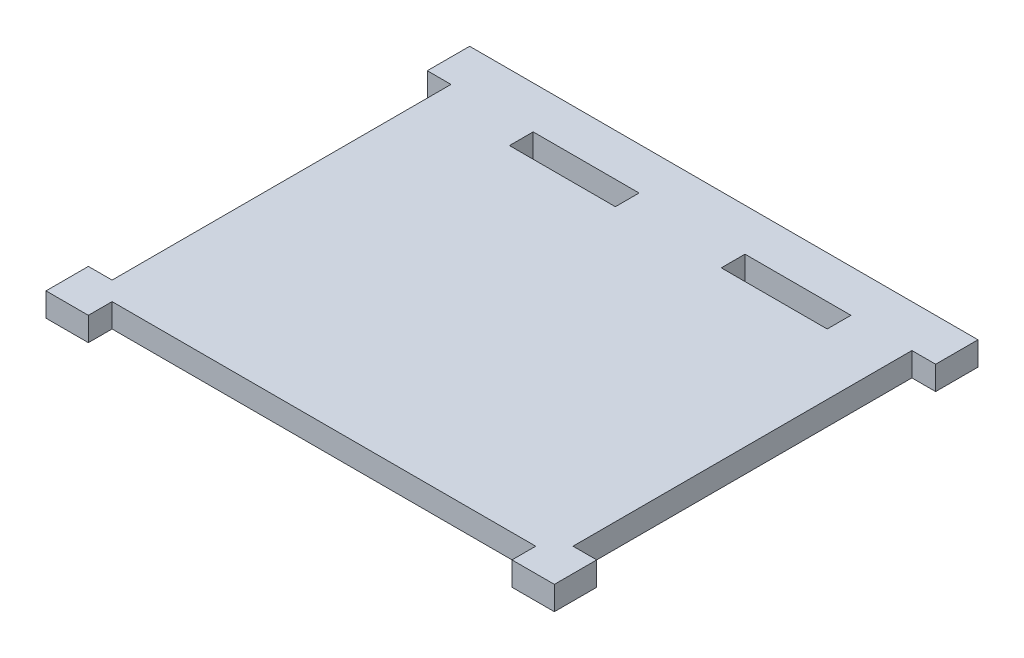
ISO-10303-21;
HEADER;
FILE_DESCRIPTION(('STEP AP214'),'2;1');
FILE_NAME('part.step','',(''),(''),'','','');
FILE_SCHEMA(('AUTOMOTIVE_DESIGN { 1 0 10303 214 1 1 1 1 }'));
ENDSEC;
DATA;
#1=APPLICATION_CONTEXT('core data for automotive mechanical design processes');
#2=APPLICATION_PROTOCOL_DEFINITION('international standard','automotive_design',2000,#1);
#3=PRODUCT_CONTEXT('',#1,'mechanical');
#4=PRODUCT('Part','Part','',(#3));
#5=PRODUCT_RELATED_PRODUCT_CATEGORY('part','',(#4));
#6=PRODUCT_DEFINITION_FORMATION('','',#4);
#7=PRODUCT_DEFINITION_CONTEXT('part definition',#1,'design');
#8=PRODUCT_DEFINITION('design','',#6,#7);
#9=PRODUCT_DEFINITION_SHAPE('','',#8);
#10=(LENGTH_UNIT() NAMED_UNIT(*) SI_UNIT(.MILLI.,.METRE.));
#11=(NAMED_UNIT(*) PLANE_ANGLE_UNIT() SI_UNIT($,.RADIAN.));
#12=(NAMED_UNIT(*) SI_UNIT($,.STERADIAN.) SOLID_ANGLE_UNIT());
#13=UNCERTAINTY_MEASURE_WITH_UNIT(LENGTH_MEASURE(1.E-05),#10,'distance_accuracy_value','');
#14=(GEOMETRIC_REPRESENTATION_CONTEXT(3) GLOBAL_UNCERTAINTY_ASSIGNED_CONTEXT((#13)) GLOBAL_UNIT_ASSIGNED_CONTEXT((#10,
#11,#12)) REPRESENTATION_CONTEXT('',''));
#15=CARTESIAN_POINT('',(0.,0.,0.));
#16=DIRECTION('',(0.,0.,1.));
#17=DIRECTION('',(1.,0.,0.));
#18=AXIS2_PLACEMENT_3D('',#15,#16,#17);
#19=CARTESIAN_POINT('',(0.,2.8,0.));
#20=DIRECTION('',(1.,0.,0.));
#21=DIRECTION('',(0.,0.,-1.));
#22=AXIS2_PLACEMENT_3D('',#19,#20,#21);
#23=PLANE('',#22);
#24=DIRECTION('',(0.,0.,1.));
#25=VECTOR('',#24,1.);
#26=CARTESIAN_POINT('',(0.,0.,0.));
#27=LINE('',#26,#25);
#28=CARTESIAN_POINT('',(0.,0.,-50.));
#29=VERTEX_POINT('',#28);
#30=CARTESIAN_POINT('',(0.,0.,-45.));
#31=VERTEX_POINT('',#30);
#32=EDGE_CURVE('E355',#29,#31,#27,.T.);
#33=ORIENTED_EDGE('',*,*,#32,.T.);
#34=DIRECTION('',(0.,1.,0.));
#35=VECTOR('',#34,1.);
#36=CARTESIAN_POINT('',(0.,0.,-45.));
#37=LINE('',#36,#35);
#38=CARTESIAN_POINT('',(0.,2.8,-45.));
#39=VERTEX_POINT('',#38);
#40=EDGE_CURVE('E224',#31,#39,#37,.T.);
#41=ORIENTED_EDGE('',*,*,#40,.T.);
#42=DIRECTION('',(0.,0.,1.));
#43=VECTOR('',#42,1.);
#44=CARTESIAN_POINT('',(0.,2.8,0.));
#45=LINE('',#44,#43);
#46=CARTESIAN_POINT('',(0.,2.8,-50.));
#47=VERTEX_POINT('',#46);
#48=EDGE_CURVE('E340',#47,#39,#45,.T.);
#49=ORIENTED_EDGE('',*,*,#48,.F.);
#50=DIRECTION('',(0.,-1.,0.));
#51=VECTOR('',#50,1.);
#52=CARTESIAN_POINT('',(0.,2.8,-50.));
#53=LINE('',#52,#51);
#54=EDGE_CURVE('E354',#47,#29,#53,.T.);
#55=ORIENTED_EDGE('',*,*,#54,.T.);
#56=EDGE_LOOP('',(#33,#41,#49,#55));
#57=FACE_BOUND('',#56,.T.);
#58=ADVANCED_FACE('F32',(#57),#23,.F.);
#59=CARTESIAN_POINT('',(0.,2.8,0.));
#60=DIRECTION('',(0.,0.,-1.));
#61=DIRECTION('',(-1.,0.,0.));
#62=AXIS2_PLACEMENT_3D('',#59,#60,#61);
#63=PLANE('',#62);
#64=DIRECTION('',(1.,0.,0.));
#65=VECTOR('',#64,1.);
#66=CARTESIAN_POINT('',(0.,0.,0.));
#67=LINE('',#66,#65);
#68=CARTESIAN_POINT('',(0.,0.,0.));
#69=VERTEX_POINT('',#68);
#70=CARTESIAN_POINT('',(5.,0.,0.));
#71=VERTEX_POINT('',#70);
#72=EDGE_CURVE('E359',#69,#71,#67,.T.);
#73=ORIENTED_EDGE('',*,*,#72,.T.);
#74=DIRECTION('',(0.,1.,0.));
#75=VECTOR('',#74,1.);
#76=CARTESIAN_POINT('',(5.,0.,0.));
#77=LINE('',#76,#75);
#78=CARTESIAN_POINT('',(5.,2.8,0.));
#79=VERTEX_POINT('',#78);
#80=EDGE_CURVE('E238',#71,#79,#77,.T.);
#81=ORIENTED_EDGE('',*,*,#80,.T.);
#82=DIRECTION('',(1.,0.,0.));
#83=VECTOR('',#82,1.);
#84=CARTESIAN_POINT('',(0.,2.8,0.));
#85=LINE('',#84,#83);
#86=CARTESIAN_POINT('',(0.,2.8,0.));
#87=VERTEX_POINT('',#86);
#88=EDGE_CURVE('E345',#87,#79,#85,.T.);
#89=ORIENTED_EDGE('',*,*,#88,.F.);
#90=DIRECTION('',(0.,-1.,0.));
#91=VECTOR('',#90,1.);
#92=CARTESIAN_POINT('',(0.,2.8,0.));
#93=LINE('',#92,#91);
#94=EDGE_CURVE('E11',#87,#69,#93,.T.);
#95=ORIENTED_EDGE('',*,*,#94,.T.);
#96=EDGE_LOOP('',(#73,#81,#89,#95));
#97=FACE_BOUND('',#96,.T.);
#98=ADVANCED_FACE('F401',(#97),#63,.F.);
#99=CARTESIAN_POINT('',(60.,2.8,0.));
#100=DIRECTION('',(-1.,0.,0.));
#101=DIRECTION('',(0.,0.,1.));
#102=AXIS2_PLACEMENT_3D('',#99,#100,#101);
#103=PLANE('',#102);
#104=DIRECTION('',(0.,0.,-1.));
#105=VECTOR('',#104,1.);
#106=CARTESIAN_POINT('',(60.,0.,0.));
#107=LINE('',#106,#105);
#108=CARTESIAN_POINT('',(60.,0.,0.));
#109=VERTEX_POINT('',#108);
#110=CARTESIAN_POINT('',(60.,0.,-5.));
#111=VERTEX_POINT('',#110);
#112=EDGE_CURVE('E363',#109,#111,#107,.T.);
#113=ORIENTED_EDGE('',*,*,#112,.T.);
#114=DIRECTION('',(0.,1.,0.));
#115=VECTOR('',#114,1.);
#116=CARTESIAN_POINT('',(60.,0.,-5.));
#117=LINE('',#116,#115);
#118=CARTESIAN_POINT('',(60.,2.8,-5.));
#119=VERTEX_POINT('',#118);
#120=EDGE_CURVE('E242',#111,#119,#117,.T.);
#121=ORIENTED_EDGE('',*,*,#120,.T.);
#122=DIRECTION('',(0.,0.,-1.));
#123=VECTOR('',#122,1.);
#124=CARTESIAN_POINT('',(60.,2.8,0.));
#125=LINE('',#124,#123);
#126=CARTESIAN_POINT('',(60.,2.8,0.));
#127=VERTEX_POINT('',#126);
#128=EDGE_CURVE('E349',#127,#119,#125,.T.);
#129=ORIENTED_EDGE('',*,*,#128,.F.);
#130=DIRECTION('',(0.,-1.,0.));
#131=VECTOR('',#130,1.);
#132=CARTESIAN_POINT('',(60.,2.8,0.));
#133=LINE('',#132,#131);
#134=EDGE_CURVE('E40',#127,#109,#133,.T.);
#135=ORIENTED_EDGE('',*,*,#134,.T.);
#136=EDGE_LOOP('',(#113,#121,#129,#135));
#137=FACE_BOUND('',#136,.T.);
#138=ADVANCED_FACE('F377',(#137),#103,.F.);
#139=CARTESIAN_POINT('',(0.,2.8,0.));
#140=DIRECTION('',(0.,-1.,0.));
#141=DIRECTION('',(0.,0.,-1.));
#142=AXIS2_PLACEMENT_3D('',#139,#140,#141);
#143=PLANE('',#142);
#144=DIRECTION('',(0.,0.,1.));
#145=VECTOR('',#144,1.);
#146=CARTESIAN_POINT('',(12.5,2.8,-45.));
#147=LINE('',#146,#145);
#148=CARTESIAN_POINT('',(12.5,2.8,-45.));
#149=VERTEX_POINT('',#148);
#150=CARTESIAN_POINT('',(12.5,2.8,-42.2));
#151=VERTEX_POINT('',#150);
#152=EDGE_CURVE('E310',#149,#151,#147,.T.);
#153=ORIENTED_EDGE('',*,*,#152,.F.);
#154=DIRECTION('',(-1.,0.,0.));
#155=VECTOR('',#154,1.);
#156=CARTESIAN_POINT('',(12.5,2.8,-45.));
#157=LINE('',#156,#155);
#158=CARTESIAN_POINT('',(25.,2.8,-45.));
#159=VERTEX_POINT('',#158);
#160=EDGE_CURVE('E318',#159,#149,#157,.T.);
#161=ORIENTED_EDGE('',*,*,#160,.F.);
#162=DIRECTION('',(0.,0.,-1.));
#163=VECTOR('',#162,1.);
#164=CARTESIAN_POINT('',(25.,2.8,-45.));
#165=LINE('',#164,#163);
#166=CARTESIAN_POINT('',(25.,2.8,-42.2));
#167=VERTEX_POINT('',#166);
#168=EDGE_CURVE('E315',#167,#159,#165,.T.);
#169=ORIENTED_EDGE('',*,*,#168,.F.);
#170=DIRECTION('',(1.,0.,0.));
#171=VECTOR('',#170,1.);
#172=CARTESIAN_POINT('',(12.5,2.8,-42.2));
#173=LINE('',#172,#171);
#174=EDGE_CURVE('E312',#151,#167,#173,.T.);
#175=ORIENTED_EDGE('',*,*,#174,.F.);
#176=EDGE_LOOP('',(#153,#161,#169,#175));
#177=FACE_BOUND('',#176,.T.);
#178=ORIENTED_EDGE('',*,*,#48,.T.);
#179=DIRECTION('',(-1.,0.,0.));
#180=VECTOR('',#179,1.);
#181=CARTESIAN_POINT('',(0.,2.8,-45.));
#182=LINE('',#181,#180);
#183=CARTESIAN_POINT('',(2.8,2.8,-45.));
#184=VERTEX_POINT('',#183);
#185=EDGE_CURVE('E215',#184,#39,#182,.T.);
#186=ORIENTED_EDGE('',*,*,#185,.F.);
#187=DIRECTION('',(0.,0.,-1.));
#188=VECTOR('',#187,1.);
#189=CARTESIAN_POINT('',(2.8,2.8,-45.));
#190=LINE('',#189,#188);
#191=CARTESIAN_POINT('',(2.8,2.8,-5.));
#192=VERTEX_POINT('',#191);
#193=EDGE_CURVE('E217',#192,#184,#190,.T.);
#194=ORIENTED_EDGE('',*,*,#193,.F.);
#195=DIRECTION('',(1.,0.,0.));
#196=VECTOR('',#195,1.);
#197=CARTESIAN_POINT('',(0.,2.8,-5.));
#198=LINE('',#197,#196);
#199=CARTESIAN_POINT('',(0.,2.8,-5.));
#200=VERTEX_POINT('',#199);
#201=EDGE_CURVE('E195',#200,#192,#198,.T.);
#202=ORIENTED_EDGE('',*,*,#201,.F.);
#203=EDGE_CURVE('E344',#200,#87,#45,.T.);
#204=ORIENTED_EDGE('',*,*,#203,.T.);
#205=ORIENTED_EDGE('',*,*,#88,.T.);
#206=DIRECTION('',(0.,0.,1.));
#207=VECTOR('',#206,1.);
#208=CARTESIAN_POINT('',(5.,2.8,0.));
#209=LINE('',#208,#207);
#210=CARTESIAN_POINT('',(5.,2.8,-2.8));
#211=VERTEX_POINT('',#210);
#212=EDGE_CURVE('E239',#211,#79,#209,.T.);
#213=ORIENTED_EDGE('',*,*,#212,.F.);
#214=DIRECTION('',(-1.,0.,0.));
#215=VECTOR('',#214,1.);
#216=CARTESIAN_POINT('',(5.,2.8,-2.8));
#217=LINE('',#216,#215);
#218=CARTESIAN_POINT('',(55.,2.8,-2.8));
#219=VERTEX_POINT('',#218);
#220=EDGE_CURVE('E233',#219,#211,#217,.T.);
#221=ORIENTED_EDGE('',*,*,#220,.F.);
#222=DIRECTION('',(0.,0.,-1.));
#223=VECTOR('',#222,1.);
#224=CARTESIAN_POINT('',(55.,2.8,0.));
#225=LINE('',#224,#223);
#226=CARTESIAN_POINT('',(55.,2.8,0.));
#227=VERTEX_POINT('',#226);
#228=EDGE_CURVE('E241',#227,#219,#225,.T.);
#229=ORIENTED_EDGE('',*,*,#228,.F.);
#230=EDGE_CURVE('E343',#227,#127,#85,.T.);
#231=ORIENTED_EDGE('',*,*,#230,.T.);
#232=ORIENTED_EDGE('',*,*,#128,.T.);
#233=DIRECTION('',(1.,0.,0.));
#234=VECTOR('',#233,1.);
#235=CARTESIAN_POINT('',(60.,2.8,-5.));
#236=LINE('',#235,#234);
#237=CARTESIAN_POINT('',(57.2,2.8,-5.));
#238=VERTEX_POINT('',#237);
#239=EDGE_CURVE('E258',#238,#119,#236,.T.);
#240=ORIENTED_EDGE('',*,*,#239,.F.);
#241=DIRECTION('',(0.,0.,1.));
#242=VECTOR('',#241,1.);
#243=CARTESIAN_POINT('',(57.2,2.8,-5.));
#244=LINE('',#243,#242);
#245=CARTESIAN_POINT('',(57.2,2.8,-45.));
#246=VERTEX_POINT('',#245);
#247=EDGE_CURVE('E268',#246,#238,#244,.T.);
#248=ORIENTED_EDGE('',*,*,#247,.F.);
#249=DIRECTION('',(-1.,0.,0.));
#250=VECTOR('',#249,1.);
#251=CARTESIAN_POINT('',(60.,2.8,-45.));
#252=LINE('',#251,#250);
#253=CARTESIAN_POINT('',(60.,2.8,-45.));
#254=VERTEX_POINT('',#253);
#255=EDGE_CURVE('E265',#254,#246,#252,.T.);
#256=ORIENTED_EDGE('',*,*,#255,.F.);
#257=CARTESIAN_POINT('',(60.,2.8,-50.));
#258=VERTEX_POINT('',#257);
#259=EDGE_CURVE('E348',#254,#258,#125,.T.);
#260=ORIENTED_EDGE('',*,*,#259,.T.);
#261=DIRECTION('',(-1.,0.,0.));
#262=VECTOR('',#261,1.);
#263=CARTESIAN_POINT('',(0.,2.8,-50.));
#264=LINE('',#263,#262);
#265=EDGE_CURVE('E352',#258,#47,#264,.T.);
#266=ORIENTED_EDGE('',*,*,#265,.T.);
#267=EDGE_LOOP('',(#178,#186,#194,#202,#204,#205,#213,#221,#229,#231,#232,#240,#248,#256,#260,#266));
#268=FACE_BOUND('',#267,.T.);
#269=DIRECTION('',(0.,0.,1.));
#270=VECTOR('',#269,1.);
#271=CARTESIAN_POINT('',(37.5,2.8,-45.));
#272=LINE('',#271,#270);
#273=CARTESIAN_POINT('',(37.5,2.8,-45.));
#274=VERTEX_POINT('',#273);
#275=CARTESIAN_POINT('',(37.5,2.8,-42.2));
#276=VERTEX_POINT('',#275);
#277=EDGE_CURVE('E279',#274,#276,#272,.T.);
#278=ORIENTED_EDGE('',*,*,#277,.F.);
#279=DIRECTION('',(-1.,0.,0.));
#280=VECTOR('',#279,1.);
#281=CARTESIAN_POINT('',(37.5,2.8,-45.));
#282=LINE('',#281,#280);
#283=CARTESIAN_POINT('',(50.,2.8,-45.));
#284=VERTEX_POINT('',#283);
#285=EDGE_CURVE('E287',#284,#274,#282,.T.);
#286=ORIENTED_EDGE('',*,*,#285,.F.);
#287=DIRECTION('',(0.,0.,-1.));
#288=VECTOR('',#287,1.);
#289=CARTESIAN_POINT('',(50.,2.8,-45.));
#290=LINE('',#289,#288);
#291=CARTESIAN_POINT('',(50.,2.8,-42.2));
#292=VERTEX_POINT('',#291);
#293=EDGE_CURVE('E284',#292,#284,#290,.T.);
#294=ORIENTED_EDGE('',*,*,#293,.F.);
#295=DIRECTION('',(1.,0.,0.));
#296=VECTOR('',#295,1.);
#297=CARTESIAN_POINT('',(37.5,2.8,-42.2));
#298=LINE('',#297,#296);
#299=EDGE_CURVE('E281',#276,#292,#298,.T.);
#300=ORIENTED_EDGE('',*,*,#299,.F.);
#301=EDGE_LOOP('',(#278,#286,#294,#300));
#302=FACE_BOUND('',#301,.T.);
#303=ADVANCED_FACE('F387',(#177,#268,#302),#143,.F.);
#304=CARTESIAN_POINT('',(0.,0.,0.));
#305=DIRECTION('',(0.,-1.,0.));
#306=DIRECTION('',(0.,0.,-1.));
#307=AXIS2_PLACEMENT_3D('',#304,#305,#306);
#308=PLANE('',#307);
#309=DIRECTION('',(-1.,0.,0.));
#310=VECTOR('',#309,1.);
#311=CARTESIAN_POINT('',(0.,0.,-45.));
#312=LINE('',#311,#310);
#313=CARTESIAN_POINT('',(2.8,0.,-45.));
#314=VERTEX_POINT('',#313);
#315=EDGE_CURVE('E208',#314,#31,#312,.T.);
#316=ORIENTED_EDGE('',*,*,#315,.T.);
#317=ORIENTED_EDGE('',*,*,#32,.F.);
#318=DIRECTION('',(-1.,0.,0.));
#319=VECTOR('',#318,1.);
#320=CARTESIAN_POINT('',(0.,0.,-50.));
#321=LINE('',#320,#319);
#322=CARTESIAN_POINT('',(60.,0.,-50.));
#323=VERTEX_POINT('',#322);
#324=EDGE_CURVE('E366',#323,#29,#321,.T.);
#325=ORIENTED_EDGE('',*,*,#324,.F.);
#326=CARTESIAN_POINT('',(60.,0.,-45.));
#327=VERTEX_POINT('',#326);
#328=EDGE_CURVE('E362',#327,#323,#107,.T.);
#329=ORIENTED_EDGE('',*,*,#328,.F.);
#330=DIRECTION('',(-1.,0.,0.));
#331=VECTOR('',#330,1.);
#332=CARTESIAN_POINT('',(60.,0.,-45.));
#333=LINE('',#332,#331);
#334=CARTESIAN_POINT('',(57.2,0.,-45.));
#335=VERTEX_POINT('',#334);
#336=EDGE_CURVE('E254',#327,#335,#333,.T.);
#337=ORIENTED_EDGE('',*,*,#336,.T.);
#338=DIRECTION('',(0.,0.,1.));
#339=VECTOR('',#338,1.);
#340=CARTESIAN_POINT('',(57.2,0.,-5.));
#341=LINE('',#340,#339);
#342=CARTESIAN_POINT('',(57.2,0.,-5.));
#343=VERTEX_POINT('',#342);
#344=EDGE_CURVE('E257',#335,#343,#341,.T.);
#345=ORIENTED_EDGE('',*,*,#344,.T.);
#346=DIRECTION('',(1.,0.,0.));
#347=VECTOR('',#346,1.);
#348=CARTESIAN_POINT('',(60.,0.,-5.));
#349=LINE('',#348,#347);
#350=EDGE_CURVE('E261',#343,#111,#349,.T.);
#351=ORIENTED_EDGE('',*,*,#350,.T.);
#352=ORIENTED_EDGE('',*,*,#112,.F.);
#353=CARTESIAN_POINT('',(55.,0.,0.));
#354=VERTEX_POINT('',#353);
#355=EDGE_CURVE('E358',#354,#109,#67,.T.);
#356=ORIENTED_EDGE('',*,*,#355,.F.);
#357=DIRECTION('',(0.,0.,-1.));
#358=VECTOR('',#357,1.);
#359=CARTESIAN_POINT('',(55.,0.,0.));
#360=LINE('',#359,#358);
#361=CARTESIAN_POINT('',(55.,0.,-2.8));
#362=VERTEX_POINT('',#361);
#363=EDGE_CURVE('E55',#354,#362,#360,.T.);
#364=ORIENTED_EDGE('',*,*,#363,.T.);
#365=DIRECTION('',(-1.,0.,0.));
#366=VECTOR('',#365,1.);
#367=CARTESIAN_POINT('',(5.,0.,-2.8));
#368=LINE('',#367,#366);
#369=CARTESIAN_POINT('',(5.,0.,-2.8));
#370=VERTEX_POINT('',#369);
#371=EDGE_CURVE('E235',#362,#370,#368,.T.);
#372=ORIENTED_EDGE('',*,*,#371,.T.);
#373=DIRECTION('',(0.,0.,1.));
#374=VECTOR('',#373,1.);
#375=CARTESIAN_POINT('',(5.,0.,0.));
#376=LINE('',#375,#374);
#377=EDGE_CURVE('E230',#370,#71,#376,.T.);
#378=ORIENTED_EDGE('',*,*,#377,.T.);
#379=ORIENTED_EDGE('',*,*,#72,.F.);
#380=CARTESIAN_POINT('',(0.,0.,-5.));
#381=VERTEX_POINT('',#380);
#382=EDGE_CURVE('E214',#381,#69,#27,.T.);
#383=ORIENTED_EDGE('',*,*,#382,.F.);
#384=DIRECTION('',(1.,0.,0.));
#385=VECTOR('',#384,1.);
#386=CARTESIAN_POINT('',(0.,0.,-5.));
#387=LINE('',#386,#385);
#388=CARTESIAN_POINT('',(2.8,0.,-5.));
#389=VERTEX_POINT('',#388);
#390=EDGE_CURVE('E47',#381,#389,#387,.T.);
#391=ORIENTED_EDGE('',*,*,#390,.T.);
#392=DIRECTION('',(0.,0.,-1.));
#393=VECTOR('',#392,1.);
#394=CARTESIAN_POINT('',(2.8,0.,-45.));
#395=LINE('',#394,#393);
#396=EDGE_CURVE('E203',#389,#314,#395,.T.);
#397=ORIENTED_EDGE('',*,*,#396,.T.);
#398=EDGE_LOOP('',(#316,#317,#325,#329,#337,#345,#351,#352,#356,#364,#372,#378,#379,#383,#391,#397));
#399=FACE_BOUND('',#398,.T.);
#400=DIRECTION('',(-1.,0.,0.));
#401=VECTOR('',#400,1.);
#402=CARTESIAN_POINT('',(12.5,0.,-45.));
#403=LINE('',#402,#401);
#404=CARTESIAN_POINT('',(25.,0.,-45.));
#405=VERTEX_POINT('',#404);
#406=CARTESIAN_POINT('',(12.5,0.,-45.));
#407=VERTEX_POINT('',#406);
#408=EDGE_CURVE('E313',#405,#407,#403,.T.);
#409=ORIENTED_EDGE('',*,*,#408,.T.);
#410=DIRECTION('',(0.,0.,1.));
#411=VECTOR('',#410,1.);
#412=CARTESIAN_POINT('',(12.5,0.,-45.));
#413=LINE('',#412,#411);
#414=CARTESIAN_POINT('',(12.5,0.,-42.2));
#415=VERTEX_POINT('',#414);
#416=EDGE_CURVE('E309',#407,#415,#413,.T.);
#417=ORIENTED_EDGE('',*,*,#416,.T.);
#418=DIRECTION('',(1.,0.,0.));
#419=VECTOR('',#418,1.);
#420=CARTESIAN_POINT('',(12.5,0.,-42.2));
#421=LINE('',#420,#419);
#422=CARTESIAN_POINT('',(25.,0.,-42.2));
#423=VERTEX_POINT('',#422);
#424=EDGE_CURVE('E323',#415,#423,#421,.T.);
#425=ORIENTED_EDGE('',*,*,#424,.T.);
#426=DIRECTION('',(0.,0.,-1.));
#427=VECTOR('',#426,1.);
#428=CARTESIAN_POINT('',(25.,0.,-45.));
#429=LINE('',#428,#427);
#430=EDGE_CURVE('E326',#423,#405,#429,.T.);
#431=ORIENTED_EDGE('',*,*,#430,.T.);
#432=EDGE_LOOP('',(#409,#417,#425,#431));
#433=FACE_BOUND('',#432,.T.);
#434=DIRECTION('',(-1.,0.,0.));
#435=VECTOR('',#434,1.);
#436=CARTESIAN_POINT('',(37.5,0.,-45.));
#437=LINE('',#436,#435);
#438=CARTESIAN_POINT('',(50.,0.,-45.));
#439=VERTEX_POINT('',#438);
#440=CARTESIAN_POINT('',(37.5,0.,-45.));
#441=VERTEX_POINT('',#440);
#442=EDGE_CURVE('E282',#439,#441,#437,.T.);
#443=ORIENTED_EDGE('',*,*,#442,.T.);
#444=DIRECTION('',(0.,0.,1.));
#445=VECTOR('',#444,1.);
#446=CARTESIAN_POINT('',(37.5,0.,-45.));
#447=LINE('',#446,#445);
#448=CARTESIAN_POINT('',(37.5,0.,-42.2));
#449=VERTEX_POINT('',#448);
#450=EDGE_CURVE('E227',#441,#449,#447,.T.);
#451=ORIENTED_EDGE('',*,*,#450,.T.);
#452=DIRECTION('',(1.,0.,0.));
#453=VECTOR('',#452,1.);
#454=CARTESIAN_POINT('',(37.5,0.,-42.2));
#455=LINE('',#454,#453);
#456=CARTESIAN_POINT('',(50.,0.,-42.2));
#457=VERTEX_POINT('',#456);
#458=EDGE_CURVE('E292',#449,#457,#455,.T.);
#459=ORIENTED_EDGE('',*,*,#458,.T.);
#460=DIRECTION('',(0.,0.,-1.));
#461=VECTOR('',#460,1.);
#462=CARTESIAN_POINT('',(50.,0.,-45.));
#463=LINE('',#462,#461);
#464=EDGE_CURVE('E295',#457,#439,#463,.T.);
#465=ORIENTED_EDGE('',*,*,#464,.T.);
#466=EDGE_LOOP('',(#443,#451,#459,#465));
#467=FACE_BOUND('',#466,.T.);
#468=ADVANCED_FACE('F211',(#399,#433,#467),#308,.T.);
#469=ORIENTED_EDGE('',*,*,#203,.F.);
#470=DIRECTION('',(0.,1.,0.));
#471=VECTOR('',#470,1.);
#472=CARTESIAN_POINT('',(0.,0.,-5.));
#473=LINE('',#472,#471);
#474=EDGE_CURVE('E200',#381,#200,#473,.T.);
#475=ORIENTED_EDGE('',*,*,#474,.F.);
#476=ORIENTED_EDGE('',*,*,#382,.T.);
#477=ORIENTED_EDGE('',*,*,#94,.F.);
#478=EDGE_LOOP('',(#469,#475,#476,#477));
#479=FACE_BOUND('',#478,.T.);
#480=ADVANCED_FACE('F34',(#479),#23,.F.);
#481=ORIENTED_EDGE('',*,*,#230,.F.);
#482=DIRECTION('',(0.,1.,0.));
#483=VECTOR('',#482,1.);
#484=CARTESIAN_POINT('',(55.,0.,0.));
#485=LINE('',#484,#483);
#486=EDGE_CURVE('E250',#354,#227,#485,.T.);
#487=ORIENTED_EDGE('',*,*,#486,.F.);
#488=ORIENTED_EDGE('',*,*,#355,.T.);
#489=ORIENTED_EDGE('',*,*,#134,.F.);
#490=EDGE_LOOP('',(#481,#487,#488,#489));
#491=FACE_BOUND('',#490,.T.);
#492=ADVANCED_FACE('F392',(#491),#63,.F.);
#493=ORIENTED_EDGE('',*,*,#259,.F.);
#494=DIRECTION('',(0.,1.,0.));
#495=VECTOR('',#494,1.);
#496=CARTESIAN_POINT('',(60.,0.,-45.));
#497=LINE('',#496,#495);
#498=EDGE_CURVE('E264',#327,#254,#497,.T.);
#499=ORIENTED_EDGE('',*,*,#498,.F.);
#500=ORIENTED_EDGE('',*,*,#328,.T.);
#501=DIRECTION('',(0.,-1.,0.));
#502=VECTOR('',#501,1.);
#503=CARTESIAN_POINT('',(60.,2.8,-50.));
#504=LINE('',#503,#502);
#505=EDGE_CURVE('E370',#258,#323,#504,.T.);
#506=ORIENTED_EDGE('',*,*,#505,.F.);
#507=EDGE_LOOP('',(#493,#499,#500,#506));
#508=FACE_BOUND('',#507,.T.);
#509=ADVANCED_FACE('F421',(#508),#103,.F.);
#510=CARTESIAN_POINT('',(0.,2.8,-50.));
#511=DIRECTION('',(0.,0.,1.));
#512=DIRECTION('',(1.,0.,0.));
#513=AXIS2_PLACEMENT_3D('',#510,#511,#512);
#514=PLANE('',#513);
#515=ORIENTED_EDGE('',*,*,#324,.T.);
#516=ORIENTED_EDGE('',*,*,#54,.F.);
#517=ORIENTED_EDGE('',*,*,#265,.F.);
#518=ORIENTED_EDGE('',*,*,#505,.T.);
#519=EDGE_LOOP('',(#515,#516,#517,#518));
#520=FACE_BOUND('',#519,.T.);
#521=ADVANCED_FACE('F416',(#520),#514,.F.);
#522=CARTESIAN_POINT('',(12.5,2.8,-45.));
#523=DIRECTION('',(1.,0.,0.));
#524=DIRECTION('',(0.,0.,-1.));
#525=AXIS2_PLACEMENT_3D('',#522,#523,#524);
#526=PLANE('',#525);
#527=ORIENTED_EDGE('',*,*,#416,.F.);
#528=DIRECTION('',(0.,-1.,0.));
#529=VECTOR('',#528,1.);
#530=CARTESIAN_POINT('',(12.5,2.8,-45.));
#531=LINE('',#530,#529);
#532=EDGE_CURVE('E320',#149,#407,#531,.T.);
#533=ORIENTED_EDGE('',*,*,#532,.F.);
#534=ORIENTED_EDGE('',*,*,#152,.T.);
#535=DIRECTION('',(0.,-1.,0.));
#536=VECTOR('',#535,1.);
#537=CARTESIAN_POINT('',(12.5,2.8,-42.2));
#538=LINE('',#537,#536);
#539=EDGE_CURVE('E337',#151,#415,#538,.T.);
#540=ORIENTED_EDGE('',*,*,#539,.T.);
#541=EDGE_LOOP('',(#527,#533,#534,#540));
#542=FACE_BOUND('',#541,.T.);
#543=ADVANCED_FACE('F457',(#542),#526,.T.);
#544=CARTESIAN_POINT('',(12.5,2.8,-42.2));
#545=DIRECTION('',(0.,0.,-1.));
#546=DIRECTION('',(-1.,0.,0.));
#547=AXIS2_PLACEMENT_3D('',#544,#545,#546);
#548=PLANE('',#547);
#549=ORIENTED_EDGE('',*,*,#424,.F.);
#550=ORIENTED_EDGE('',*,*,#539,.F.);
#551=ORIENTED_EDGE('',*,*,#174,.T.);
#552=DIRECTION('',(0.,-1.,0.));
#553=VECTOR('',#552,1.);
#554=CARTESIAN_POINT('',(25.,2.8,-42.2));
#555=LINE('',#554,#553);
#556=EDGE_CURVE('E335',#167,#423,#555,.T.);
#557=ORIENTED_EDGE('',*,*,#556,.T.);
#558=EDGE_LOOP('',(#549,#550,#551,#557));
#559=FACE_BOUND('',#558,.T.);
#560=ADVANCED_FACE('F602',(#559),#548,.T.);
#561=CARTESIAN_POINT('',(25.,2.8,-45.));
#562=DIRECTION('',(-1.,0.,0.));
#563=DIRECTION('',(0.,0.,1.));
#564=AXIS2_PLACEMENT_3D('',#561,#562,#563);
#565=PLANE('',#564);
#566=ORIENTED_EDGE('',*,*,#430,.F.);
#567=ORIENTED_EDGE('',*,*,#556,.F.);
#568=ORIENTED_EDGE('',*,*,#168,.T.);
#569=DIRECTION('',(0.,-1.,0.));
#570=VECTOR('',#569,1.);
#571=CARTESIAN_POINT('',(25.,2.8,-45.));
#572=LINE('',#571,#570);
#573=EDGE_CURVE('E333',#159,#405,#572,.T.);
#574=ORIENTED_EDGE('',*,*,#573,.T.);
#575=EDGE_LOOP('',(#566,#567,#568,#574));
#576=FACE_BOUND('',#575,.T.);
#577=ADVANCED_FACE('F594',(#576),#565,.T.);
#578=CARTESIAN_POINT('',(12.5,2.8,-45.));
#579=DIRECTION('',(0.,0.,1.));
#580=DIRECTION('',(1.,0.,0.));
#581=AXIS2_PLACEMENT_3D('',#578,#579,#580);
#582=PLANE('',#581);
#583=ORIENTED_EDGE('',*,*,#408,.F.);
#584=ORIENTED_EDGE('',*,*,#573,.F.);
#585=ORIENTED_EDGE('',*,*,#160,.T.);
#586=ORIENTED_EDGE('',*,*,#532,.T.);
#587=EDGE_LOOP('',(#583,#584,#585,#586));
#588=FACE_BOUND('',#587,.T.);
#589=ADVANCED_FACE('F586',(#588),#582,.T.);
#590=CARTESIAN_POINT('',(37.5,2.8,-45.));
#591=DIRECTION('',(1.,0.,0.));
#592=DIRECTION('',(0.,0.,-1.));
#593=AXIS2_PLACEMENT_3D('',#590,#591,#592);
#594=PLANE('',#593);
#595=ORIENTED_EDGE('',*,*,#450,.F.);
#596=DIRECTION('',(0.,-1.,0.));
#597=VECTOR('',#596,1.);
#598=CARTESIAN_POINT('',(37.5,2.8,-45.));
#599=LINE('',#598,#597);
#600=EDGE_CURVE('E289',#274,#441,#599,.T.);
#601=ORIENTED_EDGE('',*,*,#600,.F.);
#602=ORIENTED_EDGE('',*,*,#277,.T.);
#603=DIRECTION('',(0.,-1.,0.));
#604=VECTOR('',#603,1.);
#605=CARTESIAN_POINT('',(37.5,2.8,-42.2));
#606=LINE('',#605,#604);
#607=EDGE_CURVE('E306',#276,#449,#606,.T.);
#608=ORIENTED_EDGE('',*,*,#607,.T.);
#609=EDGE_LOOP('',(#595,#601,#602,#608));
#610=FACE_BOUND('',#609,.T.);
#611=ADVANCED_FACE('F578',(#610),#594,.T.);
#612=CARTESIAN_POINT('',(37.5,2.8,-42.2));
#613=DIRECTION('',(0.,0.,-1.));
#614=DIRECTION('',(-1.,0.,0.));
#615=AXIS2_PLACEMENT_3D('',#612,#613,#614);
#616=PLANE('',#615);
#617=ORIENTED_EDGE('',*,*,#458,.F.);
#618=ORIENTED_EDGE('',*,*,#607,.F.);
#619=ORIENTED_EDGE('',*,*,#299,.T.);
#620=DIRECTION('',(0.,-1.,0.));
#621=VECTOR('',#620,1.);
#622=CARTESIAN_POINT('',(50.,2.8,-42.2));
#623=LINE('',#622,#621);
#624=EDGE_CURVE('E304',#292,#457,#623,.T.);
#625=ORIENTED_EDGE('',*,*,#624,.T.);
#626=EDGE_LOOP('',(#617,#618,#619,#625));
#627=FACE_BOUND('',#626,.T.);
#628=ADVANCED_FACE('F570',(#627),#616,.T.);
#629=CARTESIAN_POINT('',(50.,2.8,-45.));
#630=DIRECTION('',(-1.,0.,0.));
#631=DIRECTION('',(0.,0.,1.));
#632=AXIS2_PLACEMENT_3D('',#629,#630,#631);
#633=PLANE('',#632);
#634=ORIENTED_EDGE('',*,*,#464,.F.);
#635=ORIENTED_EDGE('',*,*,#624,.F.);
#636=ORIENTED_EDGE('',*,*,#293,.T.);
#637=DIRECTION('',(0.,-1.,0.));
#638=VECTOR('',#637,1.);
#639=CARTESIAN_POINT('',(50.,2.8,-45.));
#640=LINE('',#639,#638);
#641=EDGE_CURVE('E302',#284,#439,#640,.T.);
#642=ORIENTED_EDGE('',*,*,#641,.T.);
#643=EDGE_LOOP('',(#634,#635,#636,#642));
#644=FACE_BOUND('',#643,.T.);
#645=ADVANCED_FACE('F562',(#644),#633,.T.);
#646=CARTESIAN_POINT('',(37.5,2.8,-45.));
#647=DIRECTION('',(0.,0.,1.));
#648=DIRECTION('',(1.,0.,0.));
#649=AXIS2_PLACEMENT_3D('',#646,#647,#648);
#650=PLANE('',#649);
#651=ORIENTED_EDGE('',*,*,#442,.F.);
#652=ORIENTED_EDGE('',*,*,#641,.F.);
#653=ORIENTED_EDGE('',*,*,#285,.T.);
#654=ORIENTED_EDGE('',*,*,#600,.T.);
#655=EDGE_LOOP('',(#651,#652,#653,#654));
#656=FACE_BOUND('',#655,.T.);
#657=ADVANCED_FACE('F436',(#656),#650,.T.);
#658=CARTESIAN_POINT('',(60.,0.,-5.));
#659=DIRECTION('',(0.,0.,1.));
#660=DIRECTION('',(1.,0.,0.));
#661=AXIS2_PLACEMENT_3D('',#658,#659,#660);
#662=PLANE('',#661);
#663=ORIENTED_EDGE('',*,*,#239,.T.);
#664=ORIENTED_EDGE('',*,*,#120,.F.);
#665=ORIENTED_EDGE('',*,*,#350,.F.);
#666=DIRECTION('',(0.,1.,0.));
#667=VECTOR('',#666,1.);
#668=CARTESIAN_POINT('',(57.2,0.,-5.));
#669=LINE('',#668,#667);
#670=EDGE_CURVE('E274',#343,#238,#669,.T.);
#671=ORIENTED_EDGE('',*,*,#670,.T.);
#672=EDGE_LOOP('',(#663,#664,#665,#671));
#673=FACE_BOUND('',#672,.T.);
#674=ADVANCED_FACE('F384',(#673),#662,.F.);
#675=CARTESIAN_POINT('',(57.2,0.,-5.));
#676=DIRECTION('',(-1.,0.,0.));
#677=DIRECTION('',(0.,0.,1.));
#678=AXIS2_PLACEMENT_3D('',#675,#676,#677);
#679=PLANE('',#678);
#680=ORIENTED_EDGE('',*,*,#247,.T.);
#681=ORIENTED_EDGE('',*,*,#670,.F.);
#682=ORIENTED_EDGE('',*,*,#344,.F.);
#683=DIRECTION('',(0.,1.,0.));
#684=VECTOR('',#683,1.);
#685=CARTESIAN_POINT('',(57.2,0.,-45.));
#686=LINE('',#685,#684);
#687=EDGE_CURVE('E276',#335,#246,#686,.T.);
#688=ORIENTED_EDGE('',*,*,#687,.T.);
#689=EDGE_LOOP('',(#680,#681,#682,#688));
#690=FACE_BOUND('',#689,.T.);
#691=ADVANCED_FACE('F427',(#690),#679,.F.);
#692=CARTESIAN_POINT('',(60.,0.,-45.));
#693=DIRECTION('',(0.,0.,-1.));
#694=DIRECTION('',(-1.,0.,0.));
#695=AXIS2_PLACEMENT_3D('',#692,#693,#694);
#696=PLANE('',#695);
#697=ORIENTED_EDGE('',*,*,#255,.T.);
#698=ORIENTED_EDGE('',*,*,#687,.F.);
#699=ORIENTED_EDGE('',*,*,#336,.F.);
#700=ORIENTED_EDGE('',*,*,#498,.T.);
#701=EDGE_LOOP('',(#697,#698,#699,#700));
#702=FACE_BOUND('',#701,.T.);
#703=ADVANCED_FACE('F425',(#702),#696,.F.);
#704=CARTESIAN_POINT('',(5.,0.,0.));
#705=DIRECTION('',(-1.,0.,0.));
#706=DIRECTION('',(0.,0.,1.));
#707=AXIS2_PLACEMENT_3D('',#704,#705,#706);
#708=PLANE('',#707);
#709=ORIENTED_EDGE('',*,*,#212,.T.);
#710=ORIENTED_EDGE('',*,*,#80,.F.);
#711=ORIENTED_EDGE('',*,*,#377,.F.);
#712=DIRECTION('',(0.,1.,0.));
#713=VECTOR('',#712,1.);
#714=CARTESIAN_POINT('',(5.,0.,-2.8));
#715=LINE('',#714,#713);
#716=EDGE_CURVE('E222',#370,#211,#715,.T.);
#717=ORIENTED_EDGE('',*,*,#716,.T.);
#718=EDGE_LOOP('',(#709,#710,#711,#717));
#719=FACE_BOUND('',#718,.T.);
#720=ADVANCED_FACE('F434',(#719),#708,.F.);
#721=CARTESIAN_POINT('',(5.,0.,-2.8));
#722=DIRECTION('',(0.,0.,-1.));
#723=DIRECTION('',(-1.,0.,0.));
#724=AXIS2_PLACEMENT_3D('',#721,#722,#723);
#725=PLANE('',#724);
#726=ORIENTED_EDGE('',*,*,#220,.T.);
#727=ORIENTED_EDGE('',*,*,#716,.F.);
#728=ORIENTED_EDGE('',*,*,#371,.F.);
#729=DIRECTION('',(0.,1.,0.));
#730=VECTOR('',#729,1.);
#731=CARTESIAN_POINT('',(55.,0.,-2.8));
#732=LINE('',#731,#730);
#733=EDGE_CURVE('E248',#362,#219,#732,.T.);
#734=ORIENTED_EDGE('',*,*,#733,.T.);
#735=EDGE_LOOP('',(#726,#727,#728,#734));
#736=FACE_BOUND('',#735,.T.);
#737=ADVANCED_FACE('F397',(#736),#725,.F.);
#738=CARTESIAN_POINT('',(55.,0.,0.));
#739=DIRECTION('',(1.,0.,0.));
#740=DIRECTION('',(0.,0.,-1.));
#741=AXIS2_PLACEMENT_3D('',#738,#739,#740);
#742=PLANE('',#741);
#743=ORIENTED_EDGE('',*,*,#228,.T.);
#744=ORIENTED_EDGE('',*,*,#733,.F.);
#745=ORIENTED_EDGE('',*,*,#363,.F.);
#746=ORIENTED_EDGE('',*,*,#486,.T.);
#747=EDGE_LOOP('',(#743,#744,#745,#746));
#748=FACE_BOUND('',#747,.T.);
#749=ADVANCED_FACE('F393',(#748),#742,.F.);
#750=CARTESIAN_POINT('',(0.,0.,-45.));
#751=DIRECTION('',(0.,0.,-1.));
#752=DIRECTION('',(-1.,0.,0.));
#753=AXIS2_PLACEMENT_3D('',#750,#751,#752);
#754=PLANE('',#753);
#755=ORIENTED_EDGE('',*,*,#185,.T.);
#756=ORIENTED_EDGE('',*,*,#40,.F.);
#757=ORIENTED_EDGE('',*,*,#315,.F.);
#758=DIRECTION('',(0.,1.,0.));
#759=VECTOR('',#758,1.);
#760=CARTESIAN_POINT('',(2.8,0.,-45.));
#761=LINE('',#760,#759);
#762=EDGE_CURVE('E199',#314,#184,#761,.T.);
#763=ORIENTED_EDGE('',*,*,#762,.T.);
#764=EDGE_LOOP('',(#755,#756,#757,#763));
#765=FACE_BOUND('',#764,.T.);
#766=ADVANCED_FACE('F409',(#765),#754,.F.);
#767=CARTESIAN_POINT('',(2.8,0.,-45.));
#768=DIRECTION('',(1.,0.,0.));
#769=DIRECTION('',(0.,0.,-1.));
#770=AXIS2_PLACEMENT_3D('',#767,#768,#769);
#771=PLANE('',#770);
#772=ORIENTED_EDGE('',*,*,#193,.T.);
#773=ORIENTED_EDGE('',*,*,#762,.F.);
#774=ORIENTED_EDGE('',*,*,#396,.F.);
#775=DIRECTION('',(0.,1.,0.));
#776=VECTOR('',#775,1.);
#777=CARTESIAN_POINT('',(2.8,0.,-5.));
#778=LINE('',#777,#776);
#779=EDGE_CURVE('E191',#389,#192,#778,.T.);
#780=ORIENTED_EDGE('',*,*,#779,.T.);
#781=EDGE_LOOP('',(#772,#773,#774,#780));
#782=FACE_BOUND('',#781,.T.);
#783=ADVANCED_FACE('F204',(#782),#771,.F.);
#784=CARTESIAN_POINT('',(0.,0.,-5.));
#785=DIRECTION('',(0.,0.,1.));
#786=DIRECTION('',(1.,0.,0.));
#787=AXIS2_PLACEMENT_3D('',#784,#785,#786);
#788=PLANE('',#787);
#789=ORIENTED_EDGE('',*,*,#201,.T.);
#790=ORIENTED_EDGE('',*,*,#779,.F.);
#791=ORIENTED_EDGE('',*,*,#390,.F.);
#792=ORIENTED_EDGE('',*,*,#474,.T.);
#793=EDGE_LOOP('',(#789,#790,#791,#792));
#794=FACE_BOUND('',#793,.T.);
#795=ADVANCED_FACE('F193',(#794),#788,.F.);
#796=CLOSED_SHELL('',(#58,#98,#138,#303,#468,#480,#492,#509,#521,#543,#560,#577,#589,#611,#628,
#645,#657,#674,#691,#703,#720,#737,#749,#766,#783,#795));
#797=MANIFOLD_SOLID_BREP('B2',#796);
#798=ADVANCED_BREP_SHAPE_REPRESENTATION('',(#18,#797),#14);
#799=SHAPE_DEFINITION_REPRESENTATION(#9,#798);
ENDSEC;
END-ISO-10303-21;
